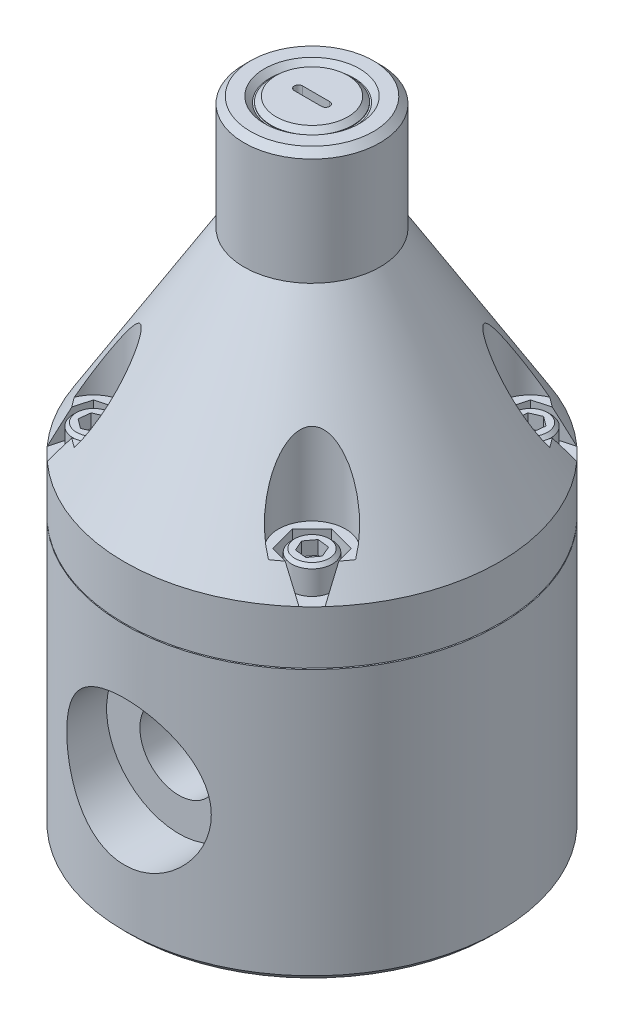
from build123d import *

# Parameters (mm, degrees)
SKETCH1_R         = 43.815
EXTRUDE1_DEPTH    = 148.59
CHAMFER1_SIZE     = 1.524
SKETCH3_R         = 11.1125
EXTRUDE2_DEPTH    = 1.27
EXTRUDE2_DRAFT    = -45
SKETCH4_R         = 9.525
EXTRUDE3_DEPTH    = 1.27
CHAMFER2_SIZE     = 1.143
EXTRUDE4_DEPTH    = 3.175
EXTRUDE4_DRAFT    = -1
SKETCH6_R         = 7.874
EXTRUDE5_DEPTH    = 22.86
EXTRUDE6_DEPTH    = 6.35
SKETCH8_R         = 4.7625
EXTRUDE7_DEPTH    = 6.35
EXTRUDE8_DEPTH    = 3.175
CIRPATTERN1_COUNT = 4
CHAMFER3_SIZE     = 0.762


with BuildPart() as part:
    # Sketch1 → Extrude1 (new body)
    with BuildSketch(Plane(origin=(0, 0, 0), x_dir=(1, 0, 0), z_dir=(0, 1, 0))):
        with Locations(Location((0, 0, 0), (0, 0, 270))):
            Circle(SKETCH1_R)
    extrude(amount=EXTRUDE1_DEPTH)

    # Sketch2 → Cut-Revolve1 (revolve, cut)
    with BuildSketch(Plane.XY, mode=Mode.PRIVATE) as cut_revolve1_sk:
        Polygon((-52.628834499, 63.5), (-30.226, 63.5), (-30.226, 63.754), (-43.815, 63.754), (-43.815, 76.2), (-15.875, 121.92), (-15.875, 152.4), (-52.628834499, 152.4), align=None)
    revolve(cut_revolve1_sk.sketch.rotate(Axis((0, 148.59, 0), (0, -1, 0)), 270), axis=Axis((0, 148.59, 0), (0, -1, 0)), mode=Mode.SUBTRACT)

    # Chamfer1
    chamfer1_edges = [part.edges().sort_by_distance(p)[0] for p in [
        (0, 0, -43.815),
        (0, 148.59, -15.875),
    ]]
    chamfer(chamfer1_edges, length=CHAMFER1_SIZE)


with BuildPart() as extrude2_tool:
    # Sketch3 → Extrude2 (with draft: the straight prism first)
    with BuildSketch(Plane(origin=(0, 148.59, 0), x_dir=(-1, 0, 0), z_dir=(0, 1, 0))):
        Circle(SKETCH3_R)
    extrude(amount=-EXTRUDE2_DEPTH)
    # Extrude2: the draft: its side faces are tilted about the plane it starts from
    extrude2_sides = [extrude2_tool.faces().sort_by_distance(p)[0] for p in [
        (11.1125, 147.955, 0),
    ]]
    draft(extrude2_sides, Plane(origin=(0, 148.59, 0), x_dir=(-1, 0, 0), z_dir=(0, 1, 0)), EXTRUDE2_DRAFT)


with BuildPart() as part_1:
    add(part.part)

    # Extrude2: cut by extrude2_tool
    add(extrude2_tool.part, mode=Mode.SUBTRACT)

    # Sketch4 → Extrude3 (add)
    with BuildSketch(Plane(origin=(0, 148.59, 0), x_dir=(-1, 0, 0), z_dir=(0, 1, 0))):
        with Locations(Location((0, 0, 0), (0, 0, 90))):
            Circle(SKETCH4_R)
    extrude(amount=-EXTRUDE3_DEPTH)

    # Chamfer2
    chamfer2_edges = [part_1.edges().sort_by_distance(p)[0] for p in [
        (0, 148.59, -9.525),
    ]]
    chamfer(chamfer2_edges, length=CHAMFER2_SIZE)


with BuildPart() as extrude4_tool:
    # Sketch5 → Extrude4 (with draft: the straight prism first)
    with BuildSketch(Plane(origin=(0, 148.59, 0), x_dir=(-1, 0, 0), z_dir=(0, 1, 0))):
        with BuildLine():
            Line((3.175, 0.9652), (-3.175, 0.9652))
            ThreePointArc((-3.175, 0.9652), (-4.1402, 0), (-3.175, -0.9652))
            Line((-3.175, -0.9652), (3.175, -0.9652))
            ThreePointArc((3.175, -0.9652), (4.1402, 0), (3.175, 0.9652))
        make_face()
    extrude(amount=-EXTRUDE4_DEPTH)
    # Extrude4: the draft: its side faces are tilted about the plane it starts from
    extrude4_sides = [extrude4_tool.faces().sort_by_distance(p)[0] for p in [
        (0, 147.0025, 0.9652),
        (4.1402, 147.0025, 0),
        (0, 147.0025, -0.9652),
        (-4.1402, 147.0025, 0),
    ]]
    draft(extrude4_sides, Plane(origin=(0, 148.59, 0), x_dir=(-1, 0, 0), z_dir=(0, 1, 0)), EXTRUDE4_DRAFT)


with BuildPart() as part_2:
    add(part_1.part)

    # Extrude4: cut by extrude4_tool
    add(extrude4_tool.part, mode=Mode.SUBTRACT)

    # Sketch6 → Extrude5 (cut)
    with BuildSketch(Plane(origin=(0, 82.55, 0), x_dir=(-1, 0, 0), z_dir=(0, 1, 0))):
        with Locations((-25.521887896, 25.521887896)):
            Circle(SKETCH6_R)
    extrude5 = extrude(amount=EXTRUDE5_DEPTH, mode=Mode.SUBTRACT)

    # Sketch7 → Extrude6 (cut)
    with BuildSketch(Plane(origin=(0, 82.55, 0), x_dir=(-1, 0, 0), z_dir=(0, 1, 0))):
        Polygon((-30.08447079, 20.959305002), (-23.85186665, 19.289283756), (-19.289283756, 23.85186665), (-20.959305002, 30.08447079), (-33.653634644, 33.653634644), align=None)
    extrude6 = extrude(amount=-EXTRUDE6_DEPTH, mode=Mode.SUBTRACT)

    # Sketch8 → Extrude7 (add)
    with BuildSketch(Plane(origin=(0, 82.55, 0), x_dir=(-1, 0, 0), z_dir=(0, 1, 0))):
        with Locations(Location((-25.521887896, 25.521887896, 0), (0, 0, 90))):
            Circle(SKETCH8_R)
    extrude7 = extrude(amount=-EXTRUDE7_DEPTH)

    # Sketch9 → Extrude8 (cut)
    with BuildSketch(Plane(origin=(0, 82.55, 0), x_dir=(-1, 0, 0), z_dir=(0, 1, 0))):
        Polygon((-23.873856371, 27.745151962), (-26.623275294, 28.060757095), (-28.271306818, 25.83749303), (-27.169919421, 23.298623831), (-24.420500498, 22.983018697), (-22.772468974, 25.206282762), align=None)
    extrude8 = extrude(amount=-EXTRUDE8_DEPTH, mode=Mode.SUBTRACT)

    # CirPattern1: Extrude5, Extrude6, Extrude7, Extrude8 ×4 about axis
    cirpattern1_axis = Axis((0, 0, 0), (0, 1, 0))
    add([extrude5.rotate(cirpattern1_axis, i * 360 / CIRPATTERN1_COUNT) for i in range(1, CIRPATTERN1_COUNT)], mode=Mode.SUBTRACT)
    add([extrude6.rotate(cirpattern1_axis, i * 360 / CIRPATTERN1_COUNT) for i in range(1, CIRPATTERN1_COUNT)], mode=Mode.SUBTRACT)
    add([extrude7.rotate(cirpattern1_axis, i * 360 / CIRPATTERN1_COUNT) for i in range(1, CIRPATTERN1_COUNT)])
    add([extrude8.rotate(cirpattern1_axis, i * 360 / CIRPATTERN1_COUNT) for i in range(1, CIRPATTERN1_COUNT)], mode=Mode.SUBTRACT)

    # Chamfer3
    chamfer3_edges = [part_2.edges().sort_by_distance(p)[0] for p in [
        (-20.759387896, 82.55, 25.521887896),
        (-25.521887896, 82.55, -20.759387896),
        (20.759387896, 82.55, -25.521887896),
        (25.521887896, 82.55, 20.759387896),
    ]]
    chamfer(chamfer3_edges, length=CHAMFER3_SIZE)

    # Sketch12 → CBORE for _00 Binding Head Machine Screw (revolve, cut)
    with BuildSketch(Plane(origin=(0, 31.75, 43.815), x_dir=(0, -1, 0), z_dir=(1, 0, 0))):
        Polygon((0, 0), (0, 29.946366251), (9.1186, 25.4), (9.1186, 12.7), (16.891, 12.7), (16.891, 0), align=None)
    cbore_for_00_binding_head_machine_screw = revolve(axis=Axis((0, 31.75, 50.165), (0, 0, -1)), mode=Mode.SUBTRACT)

    # Mirror1: CBORE for _00 Binding Head Machine Screw across plane
    add(cbore_for_00_binding_head_machine_screw.mirror(Plane.XY), mode=Mode.SUBTRACT)


solid = part_2.part
